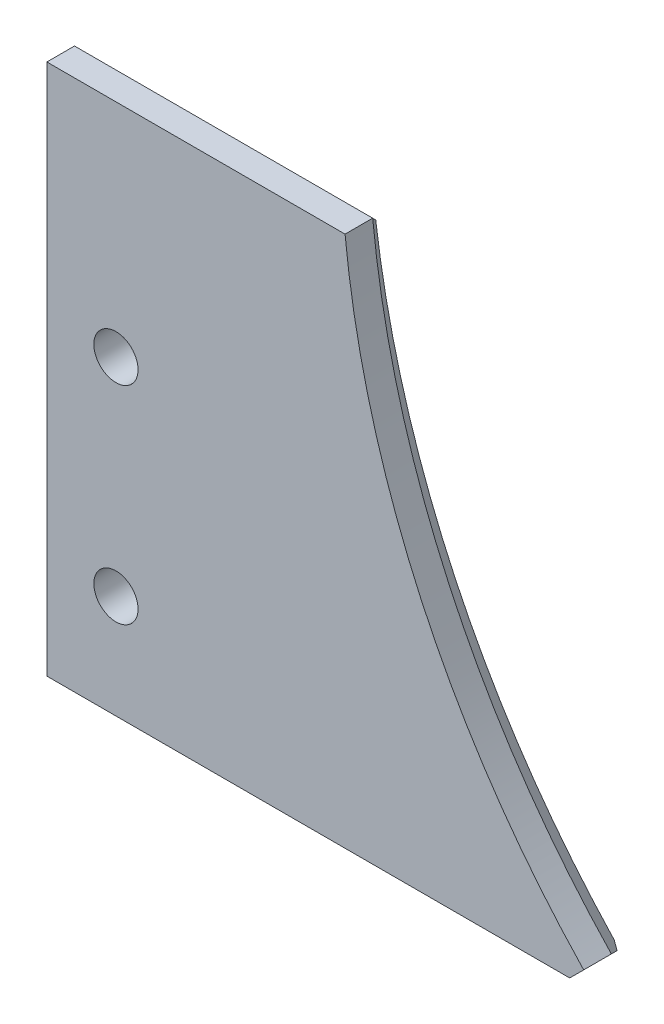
ISO-10303-21;
HEADER;
FILE_DESCRIPTION(('STEP AP214'),'2;1');
FILE_NAME('part.step','',(''),(''),'','','');
FILE_SCHEMA(('AUTOMOTIVE_DESIGN { 1 0 10303 214 1 1 1 1 }'));
ENDSEC;
DATA;
#1=APPLICATION_CONTEXT('core data for automotive mechanical design processes');
#2=APPLICATION_PROTOCOL_DEFINITION('international standard','automotive_design',2000,#1);
#3=PRODUCT_CONTEXT('',#1,'mechanical');
#4=PRODUCT('Part','Part','',(#3));
#5=PRODUCT_RELATED_PRODUCT_CATEGORY('part','',(#4));
#6=PRODUCT_DEFINITION_FORMATION('','',#4);
#7=PRODUCT_DEFINITION_CONTEXT('part definition',#1,'design');
#8=PRODUCT_DEFINITION('design','',#6,#7);
#9=PRODUCT_DEFINITION_SHAPE('','',#8);
#10=(LENGTH_UNIT() NAMED_UNIT(*) SI_UNIT(.MILLI.,.METRE.));
#11=(NAMED_UNIT(*) PLANE_ANGLE_UNIT() SI_UNIT($,.RADIAN.));
#12=(NAMED_UNIT(*) SI_UNIT($,.STERADIAN.) SOLID_ANGLE_UNIT());
#13=UNCERTAINTY_MEASURE_WITH_UNIT(LENGTH_MEASURE(1.E-05),#10,'distance_accuracy_value','');
#14=(GEOMETRIC_REPRESENTATION_CONTEXT(3) GLOBAL_UNCERTAINTY_ASSIGNED_CONTEXT((#13)) GLOBAL_UNIT_ASSIGNED_CONTEXT((#10,
#11,#12)) REPRESENTATION_CONTEXT('',''));
#15=CARTESIAN_POINT('',(0.,0.,0.));
#16=DIRECTION('',(0.,0.,1.));
#17=DIRECTION('',(1.,0.,0.));
#18=AXIS2_PLACEMENT_3D('',#15,#16,#17);
#19=CARTESIAN_POINT('',(0.,0.,4.));
#20=DIRECTION('',(0.,0.,-1.));
#21=DIRECTION('',(-1.,0.,0.));
#22=AXIS2_PLACEMENT_3D('',#19,#20,#21);
#23=CYLINDRICAL_SURFACE('',#22,63.75);
#24=CARTESIAN_POINT('',(0.,0.,4.));
#25=DIRECTION('',(0.,0.,1.));
#26=DIRECTION('',(1.,0.,0.));
#27=AXIS2_PLACEMENT_3D('',#24,#25,#26);
#28=CIRCLE('',#27,63.75);
#29=CARTESIAN_POINT('',(-63.4177617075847,-6.5,4.));
#30=VERTEX_POINT('',#29);
#31=CARTESIAN_POINT('',(-46.1431558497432,-43.987176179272,4.));
#32=VERTEX_POINT('',#31);
#33=EDGE_CURVE('E113',#30,#32,#28,.T.);
#34=ORIENTED_EDGE('',*,*,#33,.T.);
#35=DIRECTION('',(0.,0.,-1.));
#36=VECTOR('',#35,1.);
#37=CARTESIAN_POINT('',(-46.1431558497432,-43.987176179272,4.));
#38=LINE('',#37,#36);
#39=CARTESIAN_POINT('',(-46.1431558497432,-43.987176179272,2.00000000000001));
#40=VERTEX_POINT('',#39);
#41=EDGE_CURVE('E134',#32,#40,#38,.T.);
#42=ORIENTED_EDGE('',*,*,#41,.T.);
#43=CARTESIAN_POINT('',(0.,0.,2.00000000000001));
#44=DIRECTION('',(0.,0.,1.));
#45=DIRECTION('',(1.,0.,0.));
#46=AXIS2_PLACEMENT_3D('',#43,#44,#45);
#47=CIRCLE('',#46,63.75);
#48=CARTESIAN_POINT('',(-63.4177617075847,-6.5,2.00000000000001));
#49=VERTEX_POINT('',#48);
#50=EDGE_CURVE('E132',#40,#49,#47,.F.);
#51=ORIENTED_EDGE('',*,*,#50,.T.);
#52=DIRECTION('',(0.,0.,-1.));
#53=VECTOR('',#52,1.);
#54=CARTESIAN_POINT('',(-63.4177617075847,-6.5,4.));
#55=LINE('',#54,#53);
#56=EDGE_CURVE('E114',#30,#49,#55,.T.);
#57=ORIENTED_EDGE('',*,*,#56,.F.);
#58=EDGE_LOOP('',(#34,#42,#51,#57));
#59=FACE_BOUND('',#58,.T.);
#60=ADVANCED_FACE('F35',(#59),#23,.F.);
#61=CARTESIAN_POINT('',(-85.,0.,4.));
#62=DIRECTION('',(1.,0.,0.));
#63=DIRECTION('',(0.,0.,-1.));
#64=AXIS2_PLACEMENT_3D('',#61,#62,#63);
#65=PLANE('',#64);
#66=DIRECTION('',(0.,0.,1.));
#67=VECTOR('',#66,1.);
#68=CARTESIAN_POINT('',(-85.,-6.5,0.));
#69=LINE('',#68,#67);
#70=CARTESIAN_POINT('',(-85.,-6.5,2.00000000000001));
#71=VERTEX_POINT('',#70);
#72=CARTESIAN_POINT('',(-85.,-6.5,4.));
#73=VERTEX_POINT('',#72);
#74=EDGE_CURVE('E96',#71,#73,#69,.T.);
#75=ORIENTED_EDGE('',*,*,#74,.F.);
#76=DIRECTION('',(0.,0.707106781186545,0.70710678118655));
#77=VECTOR('',#76,1.);
#78=CARTESIAN_POINT('',(-85.,-8.49999999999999,0.));
#79=LINE('',#78,#77);
#80=CARTESIAN_POINT('',(-85.,-8.49999999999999,0.));
#81=VERTEX_POINT('',#80);
#82=EDGE_CURVE('E11',#71,#81,#79,.F.);
#83=ORIENTED_EDGE('',*,*,#82,.T.);
#84=DIRECTION('',(0.,-1.,0.));
#85=VECTOR('',#84,1.);
#86=CARTESIAN_POINT('',(-85.,0.,0.));
#87=LINE('',#86,#85);
#88=CARTESIAN_POINT('',(-85.,-45.,0.));
#89=VERTEX_POINT('',#88);
#90=EDGE_CURVE('E127',#81,#89,#87,.T.);
#91=ORIENTED_EDGE('',*,*,#90,.T.);
#92=DIRECTION('',(0.,0.,-1.));
#93=VECTOR('',#92,1.);
#94=CARTESIAN_POINT('',(-85.,-45.,4.));
#95=LINE('',#94,#93);
#96=CARTESIAN_POINT('',(-85.,-45.,4.));
#97=VERTEX_POINT('',#96);
#98=EDGE_CURVE('E118',#97,#89,#95,.T.);
#99=ORIENTED_EDGE('',*,*,#98,.F.);
#100=DIRECTION('',(0.,-1.,0.));
#101=VECTOR('',#100,1.);
#102=CARTESIAN_POINT('',(-85.,0.,4.));
#103=LINE('',#102,#101);
#104=EDGE_CURVE('E110',#73,#97,#103,.T.);
#105=ORIENTED_EDGE('',*,*,#104,.F.);
#106=EDGE_LOOP('',(#75,#83,#91,#99,#105));
#107=FACE_BOUND('',#106,.T.);
#108=ADVANCED_FACE('F116',(#107),#65,.F.);
#109=CARTESIAN_POINT('',(0.,-45.,4.));
#110=DIRECTION('',(0.,1.,0.));
#111=DIRECTION('',(0.,0.,1.));
#112=AXIS2_PLACEMENT_3D('',#109,#110,#111);
#113=PLANE('',#112);
#114=CARTESIAN_POINT('',(-47.9381111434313,-45.0000000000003,0.));
#115=CARTESIAN_POINT('',(-47.8079308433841,-45.0000000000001,0.0949161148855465));
#116=CARTESIAN_POINT('',(-47.6776630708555,-45.,0.189711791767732));
#117=CARTESIAN_POINT('',(-47.4169525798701,-45.,0.379062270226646));
#118=CARTESIAN_POINT('',(-47.286509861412,-45.,0.473617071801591));
#119=CARTESIAN_POINT('',(-47.1559796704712,-45.,0.56805143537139));
#120=B_SPLINE_CURVE_WITH_KNOTS('',3,(#114,#115,#116,#117,#118,#119),.UNSPECIFIED.,.F.,.F.,(4,2,
4),(0.,0.483325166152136,0.966650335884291),.UNSPECIFIED.);
#121=CARTESIAN_POINT('',(-47.9381111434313,-45.,0.));
#122=VERTEX_POINT('',#121);
#123=CARTESIAN_POINT('',(-47.1559796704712,-45.,0.56805143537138));
#124=VERTEX_POINT('',#123);
#125=EDGE_CURVE('E137',#122,#124,#120,.T.);
#126=ORIENTED_EDGE('',*,*,#125,.T.);
#127=DIRECTION('',(0.,0.,1.));
#128=VECTOR('',#127,1.);
#129=CARTESIAN_POINT('',(-47.1559796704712,-45.,4.));
#130=LINE('',#129,#128);
#131=CARTESIAN_POINT('',(-47.1559796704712,-45.,4.));
#132=VERTEX_POINT('',#131);
#133=EDGE_CURVE('E144',#124,#132,#130,.T.);
#134=ORIENTED_EDGE('',*,*,#133,.T.);
#135=DIRECTION('',(1.,0.,0.));
#136=VECTOR('',#135,1.);
#137=CARTESIAN_POINT('',(0.,-45.,4.));
#138=LINE('',#137,#136);
#139=EDGE_CURVE('E120',#97,#132,#138,.T.);
#140=ORIENTED_EDGE('',*,*,#139,.F.);
#141=ORIENTED_EDGE('',*,*,#98,.T.);
#142=DIRECTION('',(1.,0.,0.));
#143=VECTOR('',#142,1.);
#144=CARTESIAN_POINT('',(0.,-45.,0.));
#145=LINE('',#144,#143);
#146=EDGE_CURVE('E123',#89,#122,#145,.T.);
#147=ORIENTED_EDGE('',*,*,#146,.T.);
#148=EDGE_LOOP('',(#126,#134,#140,#141,#147));
#149=FACE_BOUND('',#148,.T.);
#150=ADVANCED_FACE('F149',(#149),#113,.F.);
#151=CARTESIAN_POINT('',(0.,0.,4.));
#152=DIRECTION('',(0.,0.,1.));
#153=DIRECTION('',(1.,0.,0.));
#154=AXIS2_PLACEMENT_3D('',#151,#152,#153);
#155=PLANE('',#154);
#156=CARTESIAN_POINT('',(-80.,-37.5,4.));
#157=DIRECTION('',(0.,0.,1.));
#158=DIRECTION('',(1.,0.,0.));
#159=AXIS2_PLACEMENT_3D('',#156,#157,#158);
#160=CIRCLE('',#159,1.60000000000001);
#161=CARTESIAN_POINT('',(-78.4,-37.5,4.));
#162=VERTEX_POINT('',#161);
#163=EDGE_CURVE('E217',#162,#162,#160,.T.);
#164=ORIENTED_EDGE('',*,*,#163,.F.);
#165=EDGE_LOOP('',(#164));
#166=FACE_BOUND('',#165,.T.);
#167=CARTESIAN_POINT('',(-80.,-22.5,4.));
#168=DIRECTION('',(0.,0.,1.));
#169=DIRECTION('',(1.,0.,0.));
#170=AXIS2_PLACEMENT_3D('',#167,#168,#169);
#171=CIRCLE('',#170,1.6);
#172=CARTESIAN_POINT('',(-78.4,-22.5,4.));
#173=VERTEX_POINT('',#172);
#174=EDGE_CURVE('E220',#173,#173,#171,.T.);
#175=ORIENTED_EDGE('',*,*,#174,.F.);
#176=EDGE_LOOP('',(#175));
#177=FACE_BOUND('',#176,.T.);
#178=ORIENTED_EDGE('',*,*,#139,.T.);
#179=DIRECTION('',(-0.707106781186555,-0.70710678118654,0.));
#180=VECTOR('',#179,1.);
#181=CARTESIAN_POINT('',(-1.0779898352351,1.07798983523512,4.));
#182=LINE('',#181,#180);
#183=EDGE_CURVE('E167',#132,#32,#182,.F.);
#184=ORIENTED_EDGE('',*,*,#183,.T.);
#185=ORIENTED_EDGE('',*,*,#33,.F.);
#186=DIRECTION('',(-1.,0.,0.));
#187=VECTOR('',#186,1.);
#188=CARTESIAN_POINT('',(-45.1559796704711,-6.5,4.));
#189=LINE('',#188,#187);
#190=EDGE_CURVE('E99',#30,#73,#189,.T.);
#191=ORIENTED_EDGE('',*,*,#190,.T.);
#192=ORIENTED_EDGE('',*,*,#104,.T.);
#193=EDGE_LOOP('',(#178,#184,#185,#191,#192));
#194=FACE_BOUND('',#193,.T.);
#195=ADVANCED_FACE('F109',(#166,#177,#194),#155,.T.);
#196=CARTESIAN_POINT('',(0.,0.,0.));
#197=DIRECTION('',(0.,0.,1.));
#198=DIRECTION('',(1.,0.,0.));
#199=AXIS2_PLACEMENT_3D('',#196,#197,#198);
#200=PLANE('',#199);
#201=CARTESIAN_POINT('',(-80.,-37.5,0.));
#202=DIRECTION('',(0.,0.,1.));
#203=DIRECTION('',(1.,0.,0.));
#204=AXIS2_PLACEMENT_3D('',#201,#202,#203);
#205=CIRCLE('',#204,1.60000000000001);
#206=CARTESIAN_POINT('',(-78.4,-37.5,0.));
#207=VERTEX_POINT('',#206);
#208=EDGE_CURVE('E104',#207,#207,#205,.T.);
#209=ORIENTED_EDGE('',*,*,#208,.T.);
#210=EDGE_LOOP('',(#209));
#211=FACE_BOUND('',#210,.T.);
#212=CARTESIAN_POINT('',(-80.,-22.5,0.));
#213=DIRECTION('',(0.,0.,1.));
#214=DIRECTION('',(1.,0.,0.));
#215=AXIS2_PLACEMENT_3D('',#212,#213,#214);
#216=CIRCLE('',#215,1.6);
#217=CARTESIAN_POINT('',(-78.4,-22.5,0.));
#218=VERTEX_POINT('',#217);
#219=EDGE_CURVE('E222',#218,#218,#216,.T.);
#220=ORIENTED_EDGE('',*,*,#219,.T.);
#221=EDGE_LOOP('',(#220));
#222=FACE_BOUND('',#221,.T.);
#223=DIRECTION('',(1.,0.,0.));
#224=VECTOR('',#223,1.);
#225=CARTESIAN_POINT('',(0.,-8.49999999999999,0.));
#226=LINE('',#225,#224);
#227=CARTESIAN_POINT('',(-65.198255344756,-8.49999999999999,0.));
#228=VERTEX_POINT('',#227);
#229=EDGE_CURVE('E65',#81,#228,#226,.T.);
#230=ORIENTED_EDGE('',*,*,#229,.T.);
#231=CARTESIAN_POINT('',(0.,0.,0.));
#232=DIRECTION('',(0.,0.,1.));
#233=DIRECTION('',(1.,0.,0.));
#234=AXIS2_PLACEMENT_3D('',#231,#232,#233);
#235=CIRCLE('',#234,65.75);
#236=EDGE_CURVE('E176',#228,#122,#235,.T.);
#237=ORIENTED_EDGE('',*,*,#236,.T.);
#238=ORIENTED_EDGE('',*,*,#146,.F.);
#239=ORIENTED_EDGE('',*,*,#90,.F.);
#240=EDGE_LOOP('',(#230,#237,#238,#239));
#241=FACE_BOUND('',#240,.T.);
#242=ADVANCED_FACE('F155',(#211,#222,#241),#200,.F.);
#243=CARTESIAN_POINT('',(-45.1559796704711,-6.5,0.));
#244=DIRECTION('',(0.,-1.,0.));
#245=DIRECTION('',(0.,0.,-1.));
#246=AXIS2_PLACEMENT_3D('',#243,#244,#245);
#247=PLANE('',#246);
#248=ORIENTED_EDGE('',*,*,#56,.T.);
#249=DIRECTION('',(-1.,0.,0.));
#250=VECTOR('',#249,1.);
#251=CARTESIAN_POINT('',(-45.1559796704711,-6.5,2.00000000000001));
#252=LINE('',#251,#250);
#253=EDGE_CURVE('E50',#49,#71,#252,.T.);
#254=ORIENTED_EDGE('',*,*,#253,.T.);
#255=ORIENTED_EDGE('',*,*,#74,.T.);
#256=ORIENTED_EDGE('',*,*,#190,.F.);
#257=EDGE_LOOP('',(#248,#254,#255,#256));
#258=FACE_BOUND('',#257,.T.);
#259=ADVANCED_FACE('F98',(#258),#247,.F.);
#260=CARTESIAN_POINT('',(-80.,-22.5,0.));
#261=DIRECTION('',(0.,0.,1.));
#262=DIRECTION('',(1.,0.,0.));
#263=AXIS2_PLACEMENT_3D('',#260,#261,#262);
#264=CYLINDRICAL_SURFACE('',#263,1.6);
#265=ORIENTED_EDGE('',*,*,#219,.F.);
#266=EDGE_LOOP('',(#265));
#267=FACE_BOUND('',#266,.T.);
#268=ORIENTED_EDGE('',*,*,#174,.T.);
#269=EDGE_LOOP('',(#268));
#270=FACE_BOUND('',#269,.T.);
#271=ADVANCED_FACE('F196',(#267,#270),#264,.F.);
#272=CARTESIAN_POINT('',(-80.,-37.5,0.));
#273=DIRECTION('',(0.,0.,1.));
#274=DIRECTION('',(1.,0.,0.));
#275=AXIS2_PLACEMENT_3D('',#272,#273,#274);
#276=CYLINDRICAL_SURFACE('',#275,1.60000000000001);
#277=ORIENTED_EDGE('',*,*,#208,.F.);
#278=EDGE_LOOP('',(#277));
#279=FACE_BOUND('',#278,.T.);
#280=ORIENTED_EDGE('',*,*,#163,.T.);
#281=EDGE_LOOP('',(#280));
#282=FACE_BOUND('',#281,.T.);
#283=ADVANCED_FACE('F192',(#279,#282),#276,.F.);
#284=CARTESIAN_POINT('',(0.,-8.49999999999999,0.));
#285=DIRECTION('',(0.,-0.70710678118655,0.707106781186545));
#286=DIRECTION('',(1.,0.,0.));
#287=AXIS2_PLACEMENT_3D('',#284,#285,#286);
#288=PLANE('',#287);
#289=ORIENTED_EDGE('',*,*,#82,.F.);
#290=ORIENTED_EDGE('',*,*,#253,.F.);
#291=CARTESIAN_POINT('',(-63.4177617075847,-6.5,2.00000000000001));
#292=CARTESIAN_POINT('',(-63.7174527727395,-6.83202379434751,1.66797620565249));
#293=CARTESIAN_POINT('',(-64.0156727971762,-7.16470238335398,1.33529761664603));
#294=CARTESIAN_POINT('',(-64.6091706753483,-7.83136905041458,0.668630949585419));
#295=CARTESIAN_POINT('',(-64.9044485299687,-8.16535712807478,0.334642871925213));
#296=CARTESIAN_POINT('',(-65.198255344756,-8.5,0.));
#297=B_SPLINE_CURVE_WITH_KNOTS('',3,(#291,#292,#293,#294,#295,#296),.UNSPECIFIED.,.F.,.F.,(4,2,
4),(0.,1.67109767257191,3.34219484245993),.UNSPECIFIED.);
#298=EDGE_CURVE('E40',#228,#49,#297,.F.);
#299=ORIENTED_EDGE('',*,*,#298,.F.);
#300=ORIENTED_EDGE('',*,*,#229,.F.);
#301=EDGE_LOOP('',(#289,#290,#299,#300));
#302=FACE_BOUND('',#301,.T.);
#303=ADVANCED_FACE('F37',(#302),#288,.F.);
#304=CARTESIAN_POINT('',(0.,0.,0.));
#305=DIRECTION('',(0.,0.,-1.));
#306=DIRECTION('',(-1.,0.,0.));
#307=AXIS2_PLACEMENT_3D('',#304,#305,#306);
#308=CONICAL_SURFACE('',#307,65.75,0.785398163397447);
#309=ORIENTED_EDGE('',*,*,#298,.T.);
#310=ORIENTED_EDGE('',*,*,#50,.F.);
#311=CARTESIAN_POINT('',(-46.1431558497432,-43.987176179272,2.00000000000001));
#312=CARTESIAN_POINT('',(-46.3119603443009,-44.1559806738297,1.7613426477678));
#313=CARTESIAN_POINT('',(-46.4807645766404,-44.3247849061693,1.52268492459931));
#314=CARTESIAN_POINT('',(-46.8183725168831,-44.662392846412,1.04536873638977));
#315=CARTESIAN_POINT('',(-46.9871762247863,-44.8311965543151,0.806710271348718));
#316=CARTESIAN_POINT('',(-47.1559796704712,-45.,0.568051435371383));
#317=B_SPLINE_CURVE_WITH_KNOTS('',3,(#311,#312,#313,#314,#315,#316),.UNSPECIFIED.,.F.,.F.,(4,2,
4),(0.,1.01268219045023,2.0253643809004),.UNSPECIFIED.);
#318=EDGE_CURVE('E169',#124,#40,#317,.F.);
#319=ORIENTED_EDGE('',*,*,#318,.F.);
#320=ORIENTED_EDGE('',*,*,#125,.F.);
#321=ORIENTED_EDGE('',*,*,#236,.F.);
#322=EDGE_LOOP('',(#309,#310,#319,#320,#321));
#323=FACE_BOUND('',#322,.T.);
#324=ADVANCED_FACE('F146',(#323),#308,.F.);
#325=CARTESIAN_POINT('',(-46.1431558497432,-43.987176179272,4.));
#326=DIRECTION('',(-0.70710678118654,0.707106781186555,0.));
#327=DIRECTION('',(0.,0.,-1.));
#328=AXIS2_PLACEMENT_3D('',#325,#326,#327);
#329=PLANE('',#328);
#330=ORIENTED_EDGE('',*,*,#183,.F.);
#331=ORIENTED_EDGE('',*,*,#133,.F.);
#332=ORIENTED_EDGE('',*,*,#318,.T.);
#333=ORIENTED_EDGE('',*,*,#41,.F.);
#334=EDGE_LOOP('',(#330,#331,#332,#333));
#335=FACE_BOUND('',#334,.T.);
#336=ADVANCED_FACE('F165',(#335),#329,.F.);
#337=CLOSED_SHELL('',(#60,#108,#150,#195,#242,#259,#271,#283,#303,#324,#336));
#338=MANIFOLD_SOLID_BREP('B2',#337);
#339=ADVANCED_BREP_SHAPE_REPRESENTATION('',(#18,#338),#14);
#340=SHAPE_DEFINITION_REPRESENTATION(#9,#339);
ENDSEC;
END-ISO-10303-21;
